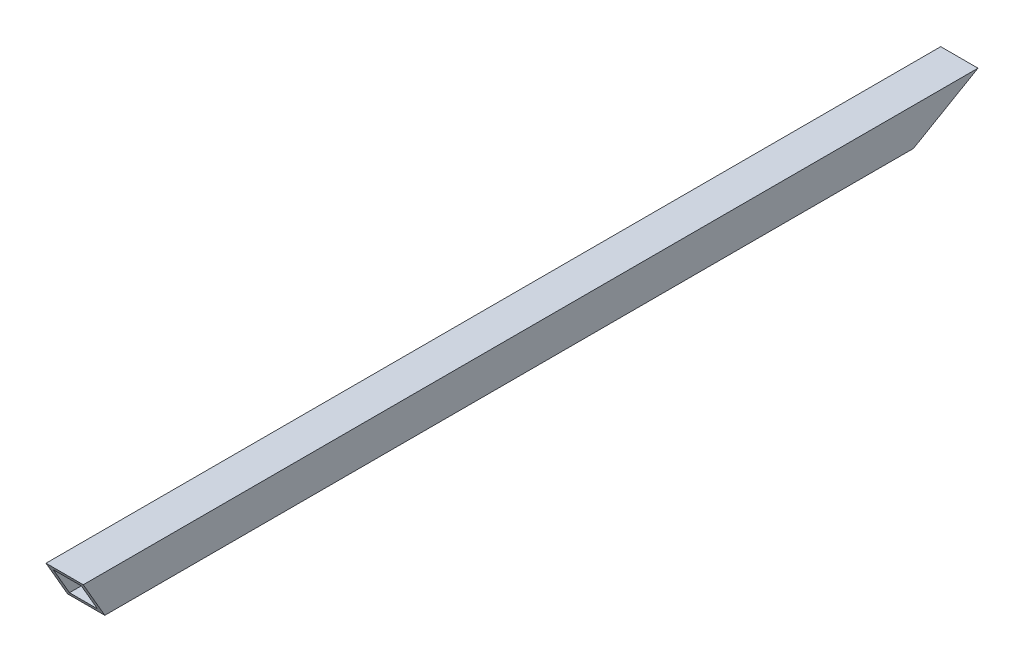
from build123d import *

# Parameters (mm, degrees)
SKETCH1_W               = 25.4
SKETCH1_H               = 25.4
SKETCH1_W_2             = 19.05
SKETCH1_H_2             = 19.05
BOSS_EXTRUDE1_DEPTH     = 609.6
CUT_EXTRUDE1_DEPTH      = 611.261099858
CUT_EXTRUDE1_DEPTH_BACK = 611.261099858
CUT_EXTRUDE2_DEPTH      = 611.261099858
CUT_EXTRUDE2_DEPTH_BACK = 611.261099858


with BuildPart() as part:
    # Sketch1 → Boss-Extrude1 (new body)
    with BuildSketch(Plane.XY):
        Rectangle(SKETCH1_W, SKETCH1_H)
        Rectangle(SKETCH1_W_2, SKETCH1_H_2, mode=Mode.SUBTRACT)
    extrude(amount=-BOSS_EXTRUDE1_DEPTH)

    # Sketch2 → Cut-Extrude1 (cut, two sides: drawn at the far end of the back side and taken through both)
    with BuildSketch(Plane(origin=(12.7, 0, 0), x_dir=(0, 0, -1), z_dir=(1, 0, 0)).offset(-CUT_EXTRUDE1_DEPTH_BACK)):
        Polygon((-615.128937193, 1078.134572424), (0, 12.7), (14.664696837, -12.7), (629.79363403, -1078.134572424), (-1501.075510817, -2308.392446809), (-2745.99808204, -152.123301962), align=None)
    extrude(amount=CUT_EXTRUDE1_DEPTH + CUT_EXTRUDE1_DEPTH_BACK, mode=Mode.SUBTRACT)

    # Sketch3 → Cut-Extrude2 (cut, two sides: drawn at the far end of the back side and taken through both)
    with BuildSketch(Plane(origin=(12.7, 0, 0), x_dir=(0, 0, -1), z_dir=(1, 0, 0)).offset(-CUT_EXTRUDE2_DEPTH_BACK)):
        Polygon((1675.034572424, 627.828937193), (609.6, 12.7), (565.605909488, -12.7), (-499.828662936, -627.828937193), (730.42921145, -2758.69808204), (2905.292446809, -1503.040207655), align=None)
    extrude(amount=CUT_EXTRUDE2_DEPTH + CUT_EXTRUDE2_DEPTH_BACK, mode=Mode.SUBTRACT)


solid = part.part
